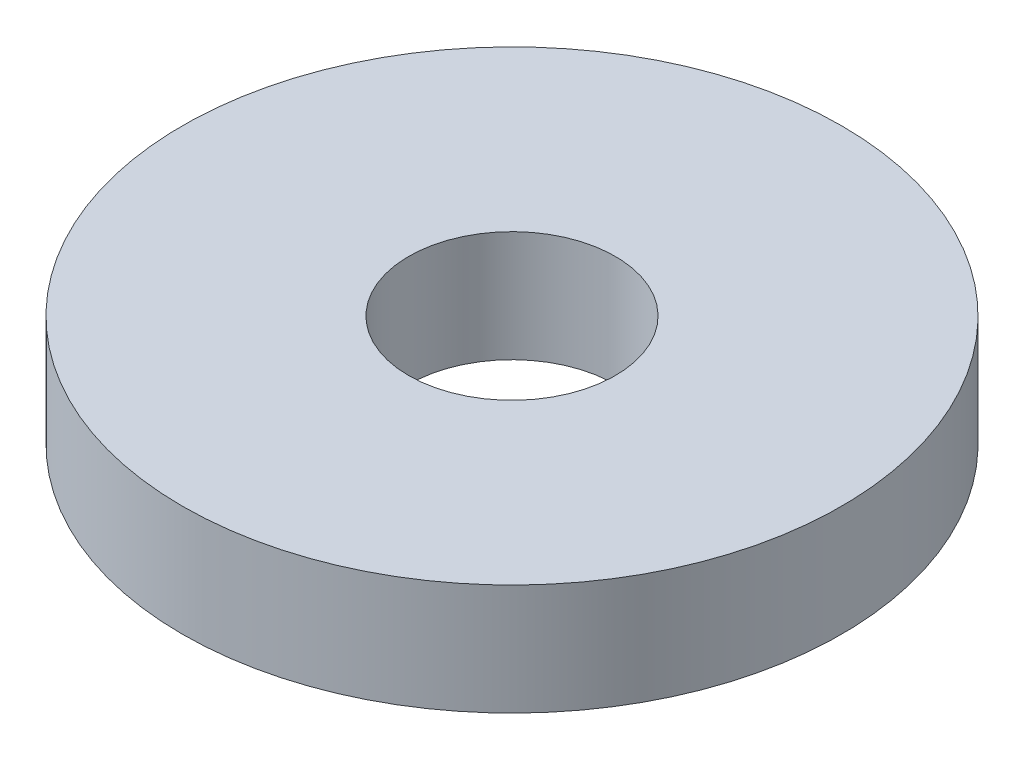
ISO-10303-21;
HEADER;
FILE_DESCRIPTION(('STEP AP214'),'2;1');
FILE_NAME('part.step','',(''),(''),'','','');
FILE_SCHEMA(('AUTOMOTIVE_DESIGN { 1 0 10303 214 1 1 1 1 }'));
ENDSEC;
DATA;
#1=APPLICATION_CONTEXT('core data for automotive mechanical design processes');
#2=APPLICATION_PROTOCOL_DEFINITION('international standard','automotive_design',2000,#1);
#3=PRODUCT_CONTEXT('',#1,'mechanical');
#4=PRODUCT('Part','Part','',(#3));
#5=PRODUCT_RELATED_PRODUCT_CATEGORY('part','',(#4));
#6=PRODUCT_DEFINITION_FORMATION('','',#4);
#7=PRODUCT_DEFINITION_CONTEXT('part definition',#1,'design');
#8=PRODUCT_DEFINITION('design','',#6,#7);
#9=PRODUCT_DEFINITION_SHAPE('','',#8);
#10=(LENGTH_UNIT() NAMED_UNIT(*) SI_UNIT(.MILLI.,.METRE.));
#11=(NAMED_UNIT(*) PLANE_ANGLE_UNIT() SI_UNIT($,.RADIAN.));
#12=(NAMED_UNIT(*) SI_UNIT($,.STERADIAN.) SOLID_ANGLE_UNIT());
#13=UNCERTAINTY_MEASURE_WITH_UNIT(LENGTH_MEASURE(1.E-05),#10,'distance_accuracy_value','');
#14=(GEOMETRIC_REPRESENTATION_CONTEXT(3) GLOBAL_UNCERTAINTY_ASSIGNED_CONTEXT((#13)) GLOBAL_UNIT_ASSIGNED_CONTEXT((#10,
#11,#12)) REPRESENTATION_CONTEXT('',''));
#15=CARTESIAN_POINT('',(0.,0.,0.));
#16=DIRECTION('',(0.,0.,1.));
#17=DIRECTION('',(1.,0.,0.));
#18=AXIS2_PLACEMENT_3D('',#15,#16,#17);
#19=CARTESIAN_POINT('',(0.,0.889,0.));
#20=DIRECTION('',(0.,1.,0.));
#21=DIRECTION('',(0.,0.,1.));
#22=AXIS2_PLACEMENT_3D('',#19,#20,#21);
#23=PLANE('',#22);
#24=CARTESIAN_POINT('',(0.,0.889,0.));
#25=DIRECTION('',(0.,1.,0.));
#26=DIRECTION('',(0.,0.,1.));
#27=AXIS2_PLACEMENT_3D('',#24,#25,#26);
#28=CIRCLE('',#27,2.6416);
#29=CARTESIAN_POINT('',(0.,0.889,2.6416));
#30=VERTEX_POINT('',#29);
#31=EDGE_CURVE('E10',#30,#30,#28,.T.);
#32=ORIENTED_EDGE('',*,*,#31,.T.);
#33=EDGE_LOOP('',(#32));
#34=FACE_BOUND('',#33,.T.);
#35=CARTESIAN_POINT('',(0.,0.889,0.));
#36=DIRECTION('',(0.,1.,0.));
#37=DIRECTION('',(0.,0.,1.));
#38=AXIS2_PLACEMENT_3D('',#35,#36,#37);
#39=CIRCLE('',#38,0.82804);
#40=CARTESIAN_POINT('',(0.,0.889,0.82804));
#41=VERTEX_POINT('',#40);
#42=EDGE_CURVE('E41',#41,#41,#39,.T.);
#43=ORIENTED_EDGE('',*,*,#42,.F.);
#44=EDGE_LOOP('',(#43));
#45=FACE_BOUND('',#44,.T.);
#46=ADVANCED_FACE('F30',(#34,#45),#23,.T.);
#47=CARTESIAN_POINT('',(0.,0.,0.));
#48=DIRECTION('',(0.,1.,0.));
#49=DIRECTION('',(0.,0.,1.));
#50=AXIS2_PLACEMENT_3D('',#47,#48,#49);
#51=PLANE('',#50);
#52=CARTESIAN_POINT('',(0.,0.,0.));
#53=DIRECTION('',(0.,1.,0.));
#54=DIRECTION('',(0.,0.,1.));
#55=AXIS2_PLACEMENT_3D('',#52,#53,#54);
#56=CIRCLE('',#55,2.6416);
#57=CARTESIAN_POINT('',(0.,0.,2.6416));
#58=VERTEX_POINT('',#57);
#59=EDGE_CURVE('E37',#58,#58,#56,.T.);
#60=ORIENTED_EDGE('',*,*,#59,.F.);
#61=EDGE_LOOP('',(#60));
#62=FACE_BOUND('',#61,.T.);
#63=CARTESIAN_POINT('',(0.,0.,0.));
#64=DIRECTION('',(0.,1.,0.));
#65=DIRECTION('',(0.,0.,1.));
#66=AXIS2_PLACEMENT_3D('',#63,#64,#65);
#67=CIRCLE('',#66,0.82804);
#68=CARTESIAN_POINT('',(0.,0.,0.82804));
#69=VERTEX_POINT('',#68);
#70=EDGE_CURVE('E45',#69,#69,#67,.T.);
#71=ORIENTED_EDGE('',*,*,#70,.T.);
#72=EDGE_LOOP('',(#71));
#73=FACE_BOUND('',#72,.T.);
#74=ADVANCED_FACE('F51',(#62,#73),#51,.F.);
#75=CARTESIAN_POINT('',(0.,0.889,0.));
#76=DIRECTION('',(0.,-1.,0.));
#77=DIRECTION('',(0.,0.,-1.));
#78=AXIS2_PLACEMENT_3D('',#75,#76,#77);
#79=CYLINDRICAL_SURFACE('',#78,2.6416);
#80=ORIENTED_EDGE('',*,*,#31,.F.);
#81=EDGE_LOOP('',(#80));
#82=FACE_BOUND('',#81,.T.);
#83=ORIENTED_EDGE('',*,*,#59,.T.);
#84=EDGE_LOOP('',(#83));
#85=FACE_BOUND('',#84,.T.);
#86=ADVANCED_FACE('F32',(#82,#85),#79,.T.);
#87=CARTESIAN_POINT('',(0.,0.889,0.));
#88=DIRECTION('',(0.,-1.,0.));
#89=DIRECTION('',(0.,0.,-1.));
#90=AXIS2_PLACEMENT_3D('',#87,#88,#89);
#91=CYLINDRICAL_SURFACE('',#90,0.82804);
#92=ORIENTED_EDGE('',*,*,#42,.T.);
#93=EDGE_LOOP('',(#92));
#94=FACE_BOUND('',#93,.T.);
#95=ORIENTED_EDGE('',*,*,#70,.F.);
#96=EDGE_LOOP('',(#95));
#97=FACE_BOUND('',#96,.T.);
#98=ADVANCED_FACE('F53',(#94,#97),#91,.F.);
#99=CLOSED_SHELL('',(#46,#74,#86,#98));
#100=MANIFOLD_SOLID_BREP('B2',#99);
#101=ADVANCED_BREP_SHAPE_REPRESENTATION('',(#18,#100),#14);
#102=SHAPE_DEFINITION_REPRESENTATION(#9,#101);
ENDSEC;
END-ISO-10303-21;
